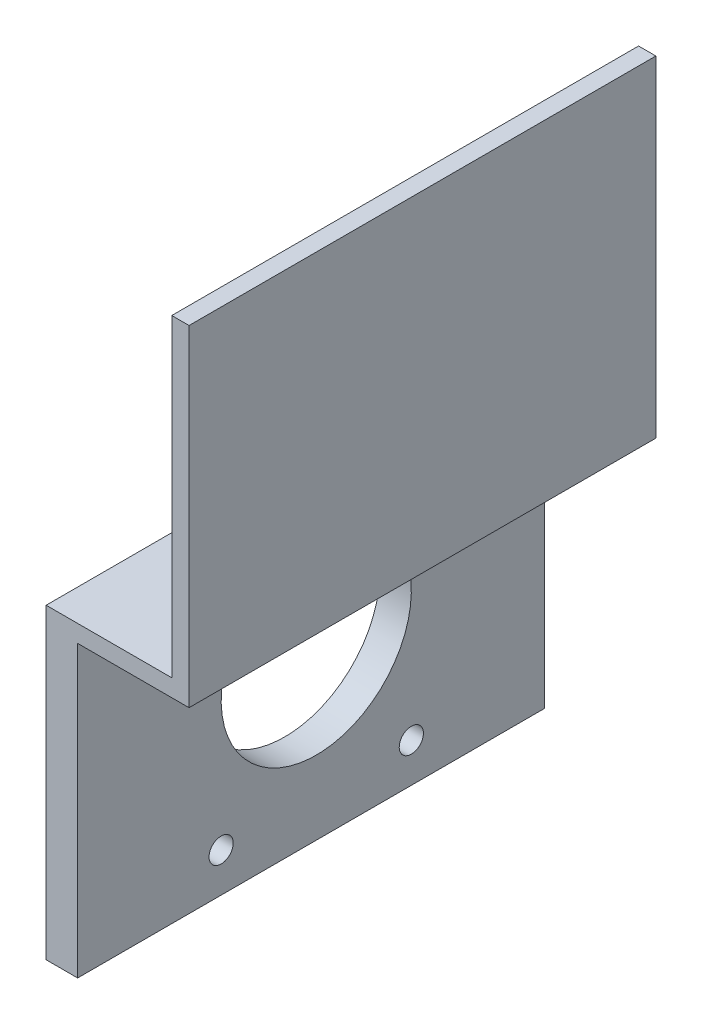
from build123d import *

# Parameters (mm, degrees)
EXTRUSION1_DEPTH        = 60
EXTRUSION1_DEPTH_BACK   = 210
ESQUISSE2_R             = 55
ESQUISSE2_R_2           = 7
ENL_V_MAT_EXTRU_1_DEPTH = 425.946454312


with BuildPart() as part:
    # Esquisse1 → Extrusion1 (new, two sides: drawn at the far end of the back side and taken through both)
    with BuildSketch(Plane.XY.offset(-EXTRUSION1_DEPTH_BACK)):
        Polygon((27.333648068, 182.323532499), (27.333648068, 4.705448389), (45.558017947, 4.705448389), (45.558017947, 172.323532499), (109.995663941, 172.323532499), (109.995663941, 363.768166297), (99.995663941, 363.768166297), (99.995663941, 182.323532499), align=None)
    extrude(amount=EXTRUSION1_DEPTH + EXTRUSION1_DEPTH_BACK)

    # Esquisse2 → Enl_v. mat.-Extru.1 (cut, through all)
    with BuildSketch(Plane(origin=(45.558017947, 0, 0), x_dir=(0, 0, -1), z_dir=(1, 0, 0))):
        with Locations(Location((78, 102.323532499, 0), (0, 0, 90))):
            Circle(ESQUISSE2_R)
        with Locations(Location((133, 152.323532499, 0), (0, 0, 90))):
            Circle(ESQUISSE2_R_2)
        with Locations(Location((23, 152.323532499, 0), (0, 0, 90))):
            Circle(ESQUISSE2_R_2)
        with Locations(Location((23, 27.323532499, 0), (0, 0, 90))):
            Circle(ESQUISSE2_R_2)
        with Locations(Location((133, 27.323532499, 0), (0, 0, 90))):
            Circle(ESQUISSE2_R_2)
    extrude(amount=-ENL_V_MAT_EXTRU_1_DEPTH, mode=Mode.SUBTRACT)


solid = part.part
